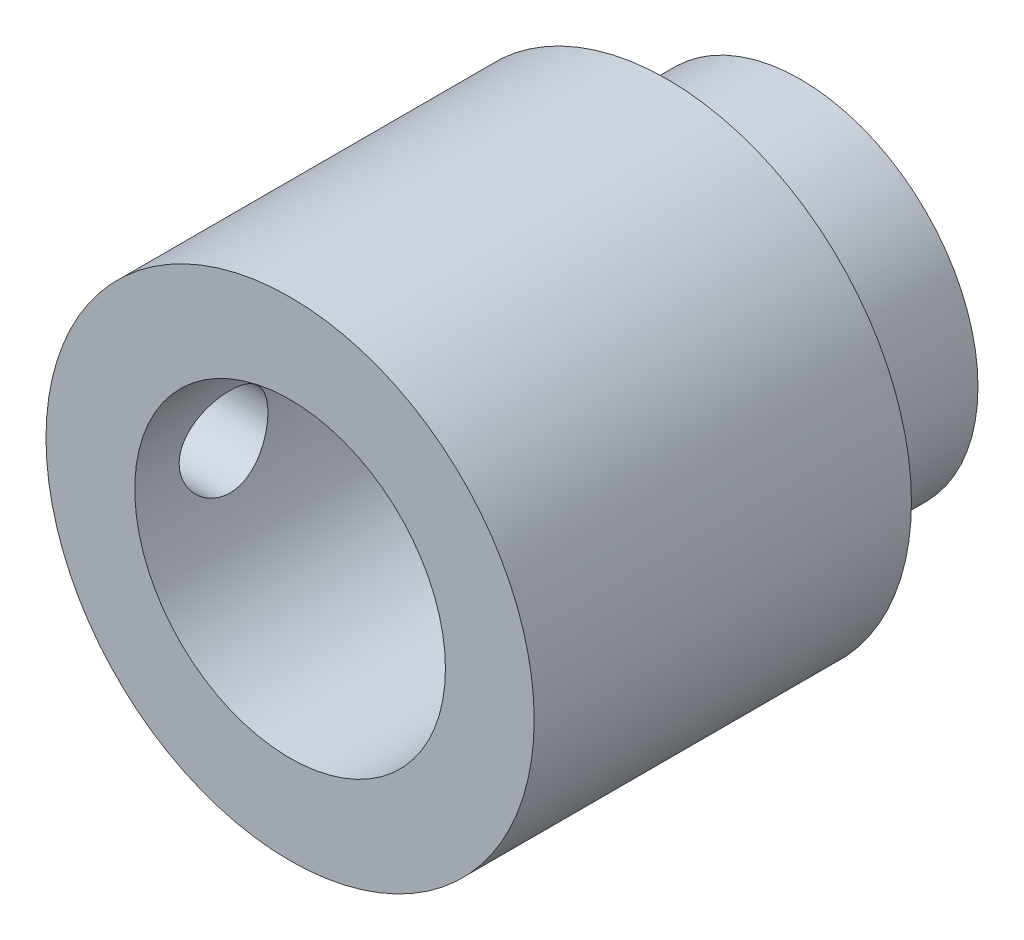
from build123d import *

# Parameters (mm, degrees)
ESQUISSE1_R               = 5.5
EXTRUSION1_DEPTH          = 8.5
TROU_TARAUD_M8X1_01_D     = 7
TROU_TARAUD_M8X1_01_DEPTH = 8
ESQUISSE4_R               = 4
EXTRUSION2_DEPTH          = 3
ESQUISSE5_R               = 2.75
ENL_V_MAT_EXTRU_1_DEPTH   = 0.9
ESQUISSE6_R               = 2
ENL_V_MAT_EXTRU_2_DEPTH   = 14.147623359
ESQUISSE7_R               = 1
ENL_V_MAT_EXTRU_3_DEPTH   = 12.521718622


with BuildPart() as part:
    # Esquisse1 → Extrusion1 (new body)
    with BuildSketch(Plane.XY):
        Circle(ESQUISSE1_R)
    extrude(amount=EXTRUSION1_DEPTH)

    # Trou taraud_ M8x1.01
    with Locations(Plane.XY.offset(8.5)):
        with Locations((0, 0)):
            Hole(TROU_TARAUD_M8X1_01_D / 2, depth=TROU_TARAUD_M8X1_01_DEPTH)

    # Esquisse4 → Extrusion2 (add)
    with BuildSketch(Plane(origin=(0, 0, 0), x_dir=(-1, 0, 0), z_dir=(0, 0, -1))):
        with Locations(Location((0, 0, 0), (0, 0, 180))):
            Circle(ESQUISSE4_R)
    extrude(amount=EXTRUSION2_DEPTH)

    # Esquisse5 → Enl_v. mat.-Extru.1 (cut)
    with BuildSketch(Plane(origin=(0, 0, -3), x_dir=(-1, 0, 0), z_dir=(0, 0, -1))):
        Circle(ESQUISSE5_R)
    extrude(amount=-ENL_V_MAT_EXTRU_1_DEPTH, mode=Mode.SUBTRACT)

    # Esquisse6 → Enl_v. mat.-Extru.2 (cut, through all)
    with BuildSketch(Plane(origin=(0, 0, -2.1), x_dir=(-1, 0, 0), z_dir=(0, 0, -1))):
        Circle(ESQUISSE6_R)
    extrude(amount=-ENL_V_MAT_EXTRU_2_DEPTH, mode=Mode.SUBTRACT)

    # Esquisse7 → Enl_v. mat.-Extru.3 (cut, through all)
    with BuildSketch(Plane(origin=(0, 0, 0), x_dir=(0, 0, -1), z_dir=(1, 0, 0))):
        with Locations((-6.5, 0)):
            Circle(ESQUISSE7_R)
    extrude(amount=-ENL_V_MAT_EXTRU_3_DEPTH, mode=Mode.SUBTRACT)


solid = part.part
